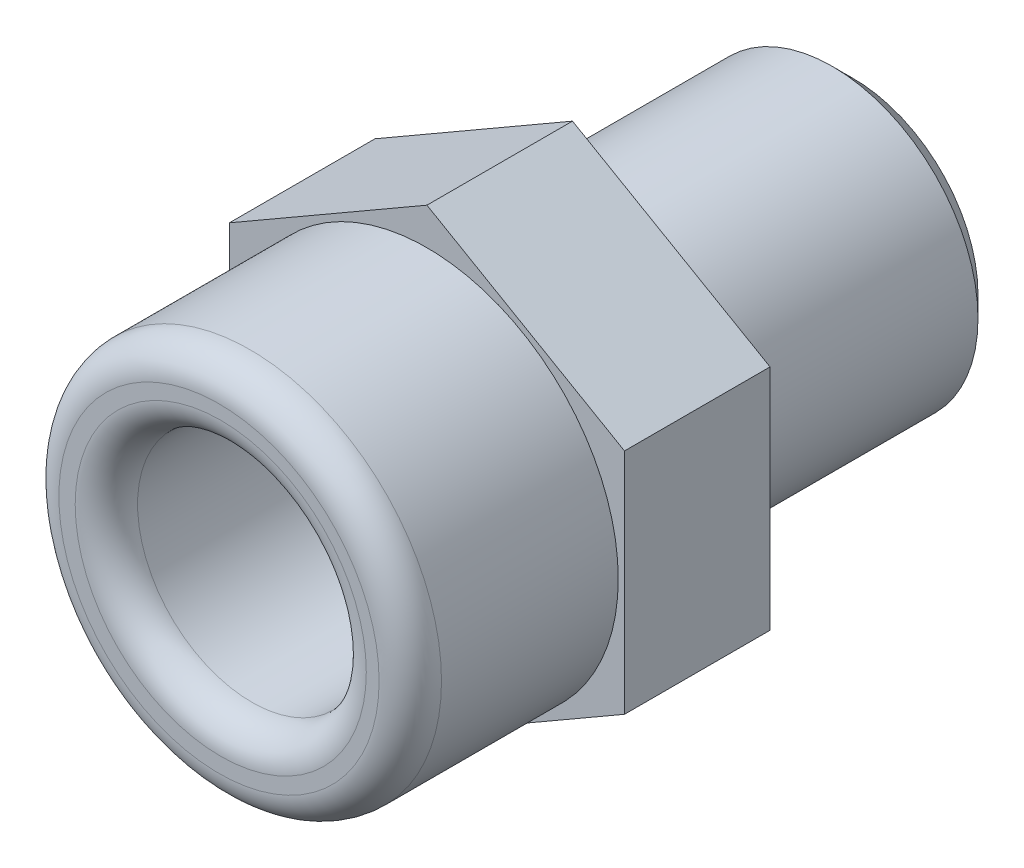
ISO-10303-21;
HEADER;
FILE_DESCRIPTION(('STEP AP214'),'2;1');
FILE_NAME('part.step','',(''),(''),'','','');
FILE_SCHEMA(('AUTOMOTIVE_DESIGN { 1 0 10303 214 1 1 1 1 }'));
ENDSEC;
DATA;
#1=APPLICATION_CONTEXT('core data for automotive mechanical design processes');
#2=APPLICATION_PROTOCOL_DEFINITION('international standard','automotive_design',2000,#1);
#3=PRODUCT_CONTEXT('',#1,'mechanical');
#4=PRODUCT('Part','Part','',(#3));
#5=PRODUCT_RELATED_PRODUCT_CATEGORY('part','',(#4));
#6=PRODUCT_DEFINITION_FORMATION('','',#4);
#7=PRODUCT_DEFINITION_CONTEXT('part definition',#1,'design');
#8=PRODUCT_DEFINITION('design','',#6,#7);
#9=PRODUCT_DEFINITION_SHAPE('','',#8);
#10=(LENGTH_UNIT() NAMED_UNIT(*) SI_UNIT(.MILLI.,.METRE.));
#11=(NAMED_UNIT(*) PLANE_ANGLE_UNIT() SI_UNIT($,.RADIAN.));
#12=(NAMED_UNIT(*) SI_UNIT($,.STERADIAN.) SOLID_ANGLE_UNIT());
#13=UNCERTAINTY_MEASURE_WITH_UNIT(LENGTH_MEASURE(1.E-05),#10,'distance_accuracy_value','');
#14=(GEOMETRIC_REPRESENTATION_CONTEXT(3) GLOBAL_UNCERTAINTY_ASSIGNED_CONTEXT((#13)) GLOBAL_UNIT_ASSIGNED_CONTEXT((#10,
#11,#12)) REPRESENTATION_CONTEXT('',''));
#15=CARTESIAN_POINT('',(0.,0.,0.));
#16=DIRECTION('',(0.,0.,1.));
#17=DIRECTION('',(1.,0.,0.));
#18=AXIS2_PLACEMENT_3D('',#15,#16,#17);
#19=CARTESIAN_POINT('',(-9.50000000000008,-5.48482755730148,0.));
#20=DIRECTION('',(0.,0.,-0.999999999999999));
#21=DIRECTION('',(-1.,0.,0.));
#22=AXIS2_PLACEMENT_3D('',#19,#20,#21);
#23=PLANE('',#22);
#24=DIRECTION('',(0.866025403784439,-0.5,0.));
#25=VECTOR('',#24,1.);
#26=CARTESIAN_POINT('',(-9.50000000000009,-5.48482755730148,0.));
#27=LINE('',#26,#25);
#28=CARTESIAN_POINT('',(-9.50000000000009,-5.48482755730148,0.));
#29=VERTEX_POINT('',#28);
#30=CARTESIAN_POINT('',(0.,-10.9696551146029,0.));
#31=VERTEX_POINT('',#30);
#32=EDGE_CURVE('E416',#29,#31,#27,.T.);
#33=ORIENTED_EDGE('',*,*,#32,.F.);
#34=DIRECTION('',(0.,-1.,0.));
#35=VECTOR('',#34,1.);
#36=CARTESIAN_POINT('',(-9.50000000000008,5.48482755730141,0.));
#37=LINE('',#36,#35);
#38=CARTESIAN_POINT('',(-9.50000000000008,5.48482755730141,0.));
#39=VERTEX_POINT('',#38);
#40=EDGE_CURVE('E446',#39,#29,#37,.T.);
#41=ORIENTED_EDGE('',*,*,#40,.F.);
#42=DIRECTION('',(-0.866025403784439,-0.5,0.));
#43=VECTOR('',#42,1.);
#44=CARTESIAN_POINT('',(0.,10.9696551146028,0.));
#45=LINE('',#44,#43);
#46=CARTESIAN_POINT('',(0.,10.9696551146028,0.));
#47=VERTEX_POINT('',#46);
#48=EDGE_CURVE('E444',#47,#39,#45,.T.);
#49=ORIENTED_EDGE('',*,*,#48,.F.);
#50=DIRECTION('',(-0.866025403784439,0.5,0.));
#51=VECTOR('',#50,1.);
#52=CARTESIAN_POINT('',(9.49999999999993,5.48482755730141,0.));
#53=LINE('',#52,#51);
#54=CARTESIAN_POINT('',(9.49999999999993,5.48482755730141,0.));
#55=VERTEX_POINT('',#54);
#56=EDGE_CURVE('E442',#55,#47,#53,.T.);
#57=ORIENTED_EDGE('',*,*,#56,.F.);
#58=DIRECTION('',(0.,1.,0.));
#59=VECTOR('',#58,1.);
#60=CARTESIAN_POINT('',(9.49999999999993,-5.48482755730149,0.));
#61=LINE('',#60,#59);
#62=CARTESIAN_POINT('',(9.49999999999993,-5.48482755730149,0.));
#63=VERTEX_POINT('',#62);
#64=EDGE_CURVE('E418',#63,#55,#61,.T.);
#65=ORIENTED_EDGE('',*,*,#64,.F.);
#66=DIRECTION('',(0.866025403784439,0.500000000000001,0.));
#67=VECTOR('',#66,1.);
#68=CARTESIAN_POINT('',(0.,-10.9696551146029,0.));
#69=LINE('',#68,#67);
#70=EDGE_CURVE('E411',#31,#63,#69,.T.);
#71=ORIENTED_EDGE('',*,*,#70,.F.);
#72=EDGE_LOOP('',(#33,#41,#49,#57,#65,#71));
#73=FACE_BOUND('',#72,.T.);
#74=CARTESIAN_POINT('',(0.,0.,0.));
#75=DIRECTION('',(0.,0.,-0.999999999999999));
#76=DIRECTION('',(-1.,0.,0.));
#77=AXIS2_PLACEMENT_3D('',#74,#75,#76);
#78=CIRCLE('',#77,7.);
#79=CARTESIAN_POINT('',(7.00000000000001,0.,0.));
#80=VERTEX_POINT('',#79);
#81=EDGE_CURVE('E434',#80,#80,#78,.T.);
#82=ORIENTED_EDGE('',*,*,#81,.F.);
#83=EDGE_LOOP('',(#82));
#84=FACE_BOUND('',#83,.T.);
#85=ADVANCED_FACE('F358',(#73,#84),#23,.T.);
#86=CARTESIAN_POINT('',(-9.50000000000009,-5.48482755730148,7.00000000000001));
#87=DIRECTION('',(0.,0.,-0.999999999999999));
#88=DIRECTION('',(-1.,0.,0.));
#89=AXIS2_PLACEMENT_3D('',#86,#87,#88);
#90=PLANE('',#89);
#91=DIRECTION('',(0.866025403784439,-0.5,0.));
#92=VECTOR('',#91,1.);
#93=CARTESIAN_POINT('',(-9.50000000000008,-5.48482755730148,7.00000000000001));
#94=LINE('',#93,#92);
#95=CARTESIAN_POINT('',(-9.50000000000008,-5.48482755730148,7.00000000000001));
#96=VERTEX_POINT('',#95);
#97=CARTESIAN_POINT('',(0.,-10.9696551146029,7.00000000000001));
#98=VERTEX_POINT('',#97);
#99=EDGE_CURVE('E448',#96,#98,#94,.T.);
#100=ORIENTED_EDGE('',*,*,#99,.T.);
#101=DIRECTION('',(0.866025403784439,0.500000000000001,0.));
#102=VECTOR('',#101,1.);
#103=CARTESIAN_POINT('',(0.,-10.9696551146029,7.00000000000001));
#104=LINE('',#103,#102);
#105=CARTESIAN_POINT('',(9.49999999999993,-5.48482755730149,7.00000000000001));
#106=VERTEX_POINT('',#105);
#107=EDGE_CURVE('E426',#98,#106,#104,.T.);
#108=ORIENTED_EDGE('',*,*,#107,.T.);
#109=DIRECTION('',(0.,1.,0.));
#110=VECTOR('',#109,1.);
#111=CARTESIAN_POINT('',(9.49999999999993,-5.48482755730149,7.00000000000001));
#112=LINE('',#111,#110);
#113=CARTESIAN_POINT('',(9.49999999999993,5.48482755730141,7.00000000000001));
#114=VERTEX_POINT('',#113);
#115=EDGE_CURVE('E451',#106,#114,#112,.T.);
#116=ORIENTED_EDGE('',*,*,#115,.T.);
#117=DIRECTION('',(-0.866025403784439,0.5,0.));
#118=VECTOR('',#117,1.);
#119=CARTESIAN_POINT('',(9.49999999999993,5.48482755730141,7.00000000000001));
#120=LINE('',#119,#118);
#121=CARTESIAN_POINT('',(0.,10.9696551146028,7.00000000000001));
#122=VERTEX_POINT('',#121);
#123=EDGE_CURVE('E453',#114,#122,#120,.T.);
#124=ORIENTED_EDGE('',*,*,#123,.T.);
#125=DIRECTION('',(-0.866025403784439,-0.5,0.));
#126=VECTOR('',#125,1.);
#127=CARTESIAN_POINT('',(0.,10.9696551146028,7.00000000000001));
#128=LINE('',#127,#126);
#129=CARTESIAN_POINT('',(-9.50000000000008,5.4848275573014,7.00000000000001));
#130=VERTEX_POINT('',#129);
#131=EDGE_CURVE('E378',#122,#130,#128,.T.);
#132=ORIENTED_EDGE('',*,*,#131,.T.);
#133=DIRECTION('',(0.,-1.,0.));
#134=VECTOR('',#133,1.);
#135=CARTESIAN_POINT('',(-9.50000000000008,5.4848275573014,7.00000000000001));
#136=LINE('',#135,#134);
#137=EDGE_CURVE('E373',#130,#96,#136,.T.);
#138=ORIENTED_EDGE('',*,*,#137,.T.);
#139=EDGE_LOOP('',(#100,#108,#116,#124,#132,#138));
#140=FACE_BOUND('',#139,.T.);
#141=CARTESIAN_POINT('',(0.,0.,7.00000000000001));
#142=DIRECTION('',(0.,0.,-0.999999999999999));
#143=DIRECTION('',(-1.,0.,0.));
#144=AXIS2_PLACEMENT_3D('',#141,#142,#143);
#145=CIRCLE('',#144,9.2);
#146=CARTESIAN_POINT('',(-9.20000000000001,0.,7.00000000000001));
#147=VERTEX_POINT('',#146);
#148=EDGE_CURVE('E429',#147,#147,#145,.F.);
#149=ORIENTED_EDGE('',*,*,#148,.F.);
#150=EDGE_LOOP('',(#149));
#151=FACE_BOUND('',#150,.T.);
#152=ADVANCED_FACE('F556',(#140,#151),#90,.F.);
#153=CARTESIAN_POINT('',(-9.50000000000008,-5.48482755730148,7.00000000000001));
#154=DIRECTION('',(0.5,0.866025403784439,0.));
#155=DIRECTION('',(-0.866025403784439,0.5,0.));
#156=AXIS2_PLACEMENT_3D('',#153,#154,#155);
#157=PLANE('',#156);
#158=ORIENTED_EDGE('',*,*,#32,.T.);
#159=DIRECTION('',(0.,0.,-0.999999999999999));
#160=VECTOR('',#159,1.);
#161=CARTESIAN_POINT('',(0.,-10.9696551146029,7.00000000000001));
#162=LINE('',#161,#160);
#163=EDGE_CURVE('E424',#98,#31,#162,.T.);
#164=ORIENTED_EDGE('',*,*,#163,.F.);
#165=ORIENTED_EDGE('',*,*,#99,.F.);
#166=DIRECTION('',(0.,0.,-0.999999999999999));
#167=VECTOR('',#166,1.);
#168=CARTESIAN_POINT('',(-9.50000000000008,-5.48482755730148,7.00000000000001));
#169=LINE('',#168,#167);
#170=EDGE_CURVE('E433',#96,#29,#169,.T.);
#171=ORIENTED_EDGE('',*,*,#170,.T.);
#172=EDGE_LOOP('',(#158,#164,#165,#171));
#173=FACE_BOUND('',#172,.T.);
#174=ADVANCED_FACE('F360',(#173),#157,.F.);
#175=CARTESIAN_POINT('',(0.,-10.9696551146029,7.00000000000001));
#176=DIRECTION('',(-0.500000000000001,0.866025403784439,0.));
#177=DIRECTION('',(-0.866025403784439,-0.500000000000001,0.));
#178=AXIS2_PLACEMENT_3D('',#175,#176,#177);
#179=PLANE('',#178);
#180=ORIENTED_EDGE('',*,*,#70,.T.);
#181=DIRECTION('',(0.,0.,-0.999999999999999));
#182=VECTOR('',#181,1.);
#183=CARTESIAN_POINT('',(9.49999999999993,-5.48482755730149,7.00000000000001));
#184=LINE('',#183,#182);
#185=EDGE_CURVE('E430',#106,#63,#184,.T.);
#186=ORIENTED_EDGE('',*,*,#185,.F.);
#187=ORIENTED_EDGE('',*,*,#107,.F.);
#188=ORIENTED_EDGE('',*,*,#163,.T.);
#189=EDGE_LOOP('',(#180,#186,#187,#188));
#190=FACE_BOUND('',#189,.T.);
#191=ADVANCED_FACE('F425',(#190),#179,.F.);
#192=CARTESIAN_POINT('',(9.49999999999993,-5.48482755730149,7.00000000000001));
#193=DIRECTION('',(-1.,0.,0.));
#194=DIRECTION('',(0.,-1.,0.));
#195=AXIS2_PLACEMENT_3D('',#192,#193,#194);
#196=PLANE('',#195);
#197=ORIENTED_EDGE('',*,*,#64,.T.);
#198=DIRECTION('',(0.,0.,-0.999999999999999));
#199=VECTOR('',#198,1.);
#200=CARTESIAN_POINT('',(9.49999999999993,5.48482755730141,7.00000000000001));
#201=LINE('',#200,#199);
#202=EDGE_CURVE('E464',#114,#55,#201,.T.);
#203=ORIENTED_EDGE('',*,*,#202,.F.);
#204=ORIENTED_EDGE('',*,*,#115,.F.);
#205=ORIENTED_EDGE('',*,*,#185,.T.);
#206=EDGE_LOOP('',(#197,#203,#204,#205));
#207=FACE_BOUND('',#206,.T.);
#208=ADVANCED_FACE('F575',(#207),#196,.F.);
#209=CARTESIAN_POINT('',(9.49999999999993,5.48482755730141,7.00000000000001));
#210=DIRECTION('',(-0.5,-0.866025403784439,0.));
#211=DIRECTION('',(0.866025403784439,-0.5,0.));
#212=AXIS2_PLACEMENT_3D('',#209,#210,#211);
#213=PLANE('',#212);
#214=ORIENTED_EDGE('',*,*,#56,.T.);
#215=DIRECTION('',(0.,0.,-0.999999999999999));
#216=VECTOR('',#215,1.);
#217=CARTESIAN_POINT('',(0.,10.9696551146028,7.00000000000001));
#218=LINE('',#217,#216);
#219=EDGE_CURVE('E461',#122,#47,#218,.T.);
#220=ORIENTED_EDGE('',*,*,#219,.F.);
#221=ORIENTED_EDGE('',*,*,#123,.F.);
#222=ORIENTED_EDGE('',*,*,#202,.T.);
#223=EDGE_LOOP('',(#214,#220,#221,#222));
#224=FACE_BOUND('',#223,.T.);
#225=ADVANCED_FACE('F571',(#224),#213,.F.);
#226=CARTESIAN_POINT('',(0.,10.9696551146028,7.00000000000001));
#227=DIRECTION('',(0.5,-0.866025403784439,0.));
#228=DIRECTION('',(0.866025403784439,0.5,0.));
#229=AXIS2_PLACEMENT_3D('',#226,#227,#228);
#230=PLANE('',#229);
#231=ORIENTED_EDGE('',*,*,#48,.T.);
#232=DIRECTION('',(0.,0.,-0.999999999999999));
#233=VECTOR('',#232,1.);
#234=CARTESIAN_POINT('',(-9.50000000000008,5.4848275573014,7.00000000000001));
#235=LINE('',#234,#233);
#236=EDGE_CURVE('E458',#130,#39,#235,.T.);
#237=ORIENTED_EDGE('',*,*,#236,.F.);
#238=ORIENTED_EDGE('',*,*,#131,.F.);
#239=ORIENTED_EDGE('',*,*,#219,.T.);
#240=EDGE_LOOP('',(#231,#237,#238,#239));
#241=FACE_BOUND('',#240,.T.);
#242=ADVANCED_FACE('F567',(#241),#230,.F.);
#243=CARTESIAN_POINT('',(-9.50000000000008,5.4848275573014,7.00000000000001));
#244=DIRECTION('',(1.,0.,0.));
#245=DIRECTION('',(0.,1.,0.));
#246=AXIS2_PLACEMENT_3D('',#243,#244,#245);
#247=PLANE('',#246);
#248=ORIENTED_EDGE('',*,*,#40,.T.);
#249=ORIENTED_EDGE('',*,*,#170,.F.);
#250=ORIENTED_EDGE('',*,*,#137,.F.);
#251=ORIENTED_EDGE('',*,*,#236,.T.);
#252=EDGE_LOOP('',(#248,#249,#250,#251));
#253=FACE_BOUND('',#252,.T.);
#254=ADVANCED_FACE('F564',(#253),#247,.F.);
#255=CARTESIAN_POINT('',(0.,0.,17.));
#256=DIRECTION('',(0.,0.,-0.999999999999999));
#257=DIRECTION('',(-1.,0.,0.));
#258=AXIS2_PLACEMENT_3D('',#255,#256,#257);
#259=CYLINDRICAL_SURFACE('',#258,9.2);
#260=CARTESIAN_POINT('',(0.,0.,15.5));
#261=DIRECTION('',(0.,0.,0.999999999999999));
#262=DIRECTION('',(1.,0.,0.));
#263=AXIS2_PLACEMENT_3D('',#260,#261,#262);
#264=CIRCLE('',#263,9.2);
#265=CARTESIAN_POINT('',(-9.2,0.,15.5));
#266=VERTEX_POINT('',#265);
#267=EDGE_CURVE('E366',#266,#266,#264,.F.);
#268=CARTESIAN_POINT('',(-9.2,0.,15.5));
#269=CARTESIAN_POINT('',(-9.2,0.,15.4114583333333));
#270=CARTESIAN_POINT('',(-9.2,0.,15.3229166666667));
#271=CARTESIAN_POINT('',(-9.2,0.,15.1458333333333));
#272=CARTESIAN_POINT('',(-9.2,0.,15.0572916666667));
#273=CARTESIAN_POINT('',(-9.2,0.,14.8802083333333));
#274=CARTESIAN_POINT('',(-9.2,0.,14.7916666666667));
#275=CARTESIAN_POINT('',(-9.2,0.,14.6145833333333));
#276=CARTESIAN_POINT('',(-9.20000000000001,0.,14.5260416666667));
#277=CARTESIAN_POINT('',(-9.20000000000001,0.,14.3489583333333));
#278=CARTESIAN_POINT('',(-9.20000000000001,0.,14.2604166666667));
#279=CARTESIAN_POINT('',(-9.20000000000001,0.,14.0833333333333));
#280=CARTESIAN_POINT('',(-9.20000000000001,0.,13.9947916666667));
#281=CARTESIAN_POINT('',(-9.20000000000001,0.,13.8177083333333));
#282=CARTESIAN_POINT('',(-9.20000000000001,0.,13.7291666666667));
#283=CARTESIAN_POINT('',(-9.20000000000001,0.,13.5520833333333));
#284=CARTESIAN_POINT('',(-9.20000000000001,0.,13.4635416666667));
#285=CARTESIAN_POINT('',(-9.20000000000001,0.,13.2864583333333));
#286=CARTESIAN_POINT('',(-9.20000000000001,0.,13.1979166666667));
#287=CARTESIAN_POINT('',(-9.20000000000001,0.,13.0208333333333));
#288=CARTESIAN_POINT('',(-9.20000000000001,0.,12.9322916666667));
#289=CARTESIAN_POINT('',(-9.20000000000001,0.,12.7552083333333));
#290=CARTESIAN_POINT('',(-9.20000000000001,0.,12.6666666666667));
#291=CARTESIAN_POINT('',(-9.20000000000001,0.,12.4895833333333));
#292=CARTESIAN_POINT('',(-9.20000000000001,0.,12.4010416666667));
#293=CARTESIAN_POINT('',(-9.20000000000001,0.,12.2239583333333));
#294=CARTESIAN_POINT('',(-9.20000000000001,0.,12.1354166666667));
#295=CARTESIAN_POINT('',(-9.20000000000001,0.,11.9583333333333));
#296=CARTESIAN_POINT('',(-9.20000000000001,0.,11.8697916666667));
#297=CARTESIAN_POINT('',(-9.20000000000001,0.,11.6927083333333));
#298=CARTESIAN_POINT('',(-9.20000000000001,0.,11.6041666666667));
#299=CARTESIAN_POINT('',(-9.20000000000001,0.,11.4270833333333));
#300=CARTESIAN_POINT('',(-9.20000000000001,0.,11.3385416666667));
#301=CARTESIAN_POINT('',(-9.20000000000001,0.,11.1614583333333));
#302=CARTESIAN_POINT('',(-9.20000000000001,0.,11.0729166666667));
#303=CARTESIAN_POINT('',(-9.20000000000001,0.,10.8958333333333));
#304=CARTESIAN_POINT('',(-9.20000000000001,0.,10.8072916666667));
#305=CARTESIAN_POINT('',(-9.20000000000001,0.,10.6302083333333));
#306=CARTESIAN_POINT('',(-9.20000000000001,0.,10.5416666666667));
#307=CARTESIAN_POINT('',(-9.20000000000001,0.,10.3645833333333));
#308=CARTESIAN_POINT('',(-9.20000000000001,0.,10.2760416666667));
#309=CARTESIAN_POINT('',(-9.20000000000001,0.,10.0989583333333));
#310=CARTESIAN_POINT('',(-9.20000000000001,0.,10.0104166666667));
#311=CARTESIAN_POINT('',(-9.20000000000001,0.,9.83333333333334));
#312=CARTESIAN_POINT('',(-9.20000000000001,0.,9.74479166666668));
#313=CARTESIAN_POINT('',(-9.20000000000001,0.,9.56770833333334));
#314=CARTESIAN_POINT('',(-9.20000000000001,0.,9.47916666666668));
#315=CARTESIAN_POINT('',(-9.20000000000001,0.,9.30208333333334));
#316=CARTESIAN_POINT('',(-9.20000000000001,0.,9.21354166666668));
#317=CARTESIAN_POINT('',(-9.20000000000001,0.,9.03645833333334));
#318=CARTESIAN_POINT('',(-9.20000000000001,0.,8.94791666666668));
#319=CARTESIAN_POINT('',(-9.20000000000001,0.,8.77083333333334));
#320=CARTESIAN_POINT('',(-9.20000000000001,0.,8.68229166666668));
#321=CARTESIAN_POINT('',(-9.20000000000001,0.,8.50520833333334));
#322=CARTESIAN_POINT('',(-9.20000000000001,0.,8.41666666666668));
#323=CARTESIAN_POINT('',(-9.20000000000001,0.,8.23958333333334));
#324=CARTESIAN_POINT('',(-9.20000000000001,0.,8.15104166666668));
#325=CARTESIAN_POINT('',(-9.20000000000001,0.,7.97395833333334));
#326=CARTESIAN_POINT('',(-9.20000000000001,0.,7.88541666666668));
#327=CARTESIAN_POINT('',(-9.20000000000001,0.,7.70833333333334));
#328=CARTESIAN_POINT('',(-9.20000000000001,0.,7.61979166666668));
#329=CARTESIAN_POINT('',(-9.20000000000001,0.,7.44270833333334));
#330=CARTESIAN_POINT('',(-9.20000000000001,0.,7.35416666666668));
#331=CARTESIAN_POINT('',(-9.20000000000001,0.,7.17708333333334));
#332=CARTESIAN_POINT('',(-9.20000000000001,0.,7.08854166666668));
#333=CARTESIAN_POINT('',(-9.20000000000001,0.,7.00000000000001));
#334=B_SPLINE_CURVE_WITH_KNOTS('',3,(#268,#269,#270,#271,#272,#273,#274,#275,#276,#277,#278,
#279,#280,#281,#282,#283,#284,#285,#286,#287,#288,#289,#290,#291,#292,#293,#294,#295,#296,#297,
#298,#299,#300,#301,#302,#303,#304,#305,#306,#307,#308,#309,#310,#311,#312,#313,#314,#315,#316,
#317,#318,#319,#320,#321,#322,#323,#324,#325,#326,#327,#328,#329,#330,#331,#332,#333),
.UNSPECIFIED.,.F.,.F.,(4,2,2,2,2,2,2,2,2,2,2,2,2,2,2,2,2,2,2,2,2,2,2,2,2,2,2,2,2,2,2,2,4),(0.,
0.265625,0.53125,0.796875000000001,1.0625,1.328125,1.59375,1.859375,2.125,2.390625,2.65625,
2.921875,3.1875,3.453125,3.71875,3.984375,4.25,4.515625,4.78125,5.046875,5.3125,
5.57812500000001,5.84375,6.109375,6.375,6.64062500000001,6.90625000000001,7.17187500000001,
7.43750000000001,7.70312500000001,7.96875000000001,8.23437500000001,8.50000000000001),.UNSPECIFIED.);
#335=EDGE_CURVE('BSEAM484',#266,#147,#334,.T.);
#336=ORIENTED_EDGE('',*,*,#267,.T.);
#337=ORIENTED_EDGE('',*,*,#148,.T.);
#338=ORIENTED_EDGE('',*,*,#335,.T.);
#339=ORIENTED_EDGE('',*,*,#335,.F.);
#340=EDGE_LOOP('',(#336,#338,#337,#339));
#341=FACE_BOUND('',#340,.T.);
#342=ADVANCED_FACE('F484',(#341),#259,.T.);
#343=CARTESIAN_POINT('',(0.,0.,17.));
#344=DIRECTION('',(0.,0.,0.999999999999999));
#345=DIRECTION('',(1.,0.,0.));
#346=AXIS2_PLACEMENT_3D('',#343,#344,#345);
#347=PLANE('',#346);
#348=CARTESIAN_POINT('',(0.,0.,17.));
#349=DIRECTION('',(0.,0.,0.999999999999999));
#350=DIRECTION('',(1.,0.,0.));
#351=AXIS2_PLACEMENT_3D('',#348,#349,#350);
#352=CIRCLE('',#351,7.7);
#353=CARTESIAN_POINT('',(7.7,0.,17.));
#354=VERTEX_POINT('',#353);
#355=EDGE_CURVE('E479',#354,#354,#352,.T.);
#356=ORIENTED_EDGE('',*,*,#355,.T.);
#357=EDGE_LOOP('',(#356));
#358=FACE_BOUND('',#357,.T.);
#359=CARTESIAN_POINT('',(0.0838658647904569,0.0559105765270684,17.));
#360=DIRECTION('',(0.,0.,0.999999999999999));
#361=DIRECTION('',(1.,0.,0.));
#362=AXIS2_PLACEMENT_3D('',#359,#360,#361);
#363=CIRCLE('',#362,7.);
#364=CARTESIAN_POINT('',(7.08386586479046,0.0559105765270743,17.));
#365=VERTEX_POINT('',#364);
#366=EDGE_CURVE('E476',#365,#365,#363,.F.);
#367=ORIENTED_EDGE('',*,*,#366,.T.);
#368=EDGE_LOOP('',(#367));
#369=FACE_BOUND('',#368,.T.);
#370=ADVANCED_FACE('F495',(#358,#369),#347,.T.);
#371=CARTESIAN_POINT('',(0.,0.,-13.5));
#372=DIRECTION('',(0.,0.,0.999999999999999));
#373=DIRECTION('',(1.,0.,0.));
#374=AXIS2_PLACEMENT_3D('',#371,#372,#373);
#375=CYLINDRICAL_SURFACE('',#374,7.);
#376=CARTESIAN_POINT('',(0.,0.,-12.5));
#377=DIRECTION('',(0.,0.,-0.999999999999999));
#378=DIRECTION('',(-1.,0.,0.));
#379=AXIS2_PLACEMENT_3D('',#376,#377,#378);
#380=CIRCLE('',#379,7.);
#381=CARTESIAN_POINT('',(7.,0.,-12.5));
#382=VERTEX_POINT('',#381);
#383=EDGE_CURVE('E473',#382,#382,#380,.F.);
#384=CARTESIAN_POINT('',(7.,0.,-12.5));
#385=CARTESIAN_POINT('',(7.,0.,-12.3697916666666));
#386=CARTESIAN_POINT('',(7.,0.,-12.2395833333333));
#387=CARTESIAN_POINT('',(7.,0.,-11.9791666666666));
#388=CARTESIAN_POINT('',(7.,0.,-11.8489583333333));
#389=CARTESIAN_POINT('',(7.,0.,-11.5885416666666));
#390=CARTESIAN_POINT('',(7.,0.,-11.4583333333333));
#391=CARTESIAN_POINT('',(7.,0.,-11.1979166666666));
#392=CARTESIAN_POINT('',(7.,0.,-11.0677083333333));
#393=CARTESIAN_POINT('',(7.,0.,-10.8072916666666));
#394=CARTESIAN_POINT('',(7.,0.,-10.6770833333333));
#395=CARTESIAN_POINT('',(7.,0.,-10.4166666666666));
#396=CARTESIAN_POINT('',(7.,0.,-10.2864583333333));
#397=CARTESIAN_POINT('',(7.,0.,-10.0260416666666));
#398=CARTESIAN_POINT('',(7.,0.,-9.89583333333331));
#399=CARTESIAN_POINT('',(7.,0.,-9.63541666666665));
#400=CARTESIAN_POINT('',(7.,0.,-9.50520833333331));
#401=CARTESIAN_POINT('',(7.,0.,-9.24479166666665));
#402=CARTESIAN_POINT('',(7.,0.,-9.11458333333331));
#403=CARTESIAN_POINT('',(7.,0.,-8.85416666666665));
#404=CARTESIAN_POINT('',(7.,0.,-8.72395833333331));
#405=CARTESIAN_POINT('',(7.,0.,-8.46354166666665));
#406=CARTESIAN_POINT('',(7.,0.,-8.33333333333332));
#407=CARTESIAN_POINT('',(7.,0.,-8.07291666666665));
#408=CARTESIAN_POINT('',(7.,0.,-7.94270833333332));
#409=CARTESIAN_POINT('',(7.,0.,-7.68229166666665));
#410=CARTESIAN_POINT('',(7.,0.,-7.55208333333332));
#411=CARTESIAN_POINT('',(7.,0.,-7.29166666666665));
#412=CARTESIAN_POINT('',(7.,0.,-7.16145833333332));
#413=CARTESIAN_POINT('',(7.,0.,-6.90104166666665));
#414=CARTESIAN_POINT('',(7.,0.,-6.77083333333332));
#415=CARTESIAN_POINT('',(7.,0.,-6.51041666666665));
#416=CARTESIAN_POINT('',(7.,0.,-6.38020833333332));
#417=CARTESIAN_POINT('',(7.,0.,-6.11979166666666));
#418=CARTESIAN_POINT('',(7.,0.,-5.98958333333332));
#419=CARTESIAN_POINT('',(7.,0.,-5.72916666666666));
#420=CARTESIAN_POINT('',(7.,0.,-5.59895833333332));
#421=CARTESIAN_POINT('',(7.,0.,-5.33854166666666));
#422=CARTESIAN_POINT('',(7.00000000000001,0.,-5.20833333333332));
#423=CARTESIAN_POINT('',(7.00000000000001,0.,-4.94791666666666));
#424=CARTESIAN_POINT('',(7.00000000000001,0.,-4.81770833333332));
#425=CARTESIAN_POINT('',(7.00000000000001,0.,-4.55729166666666));
#426=CARTESIAN_POINT('',(7.00000000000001,0.,-4.42708333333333));
#427=CARTESIAN_POINT('',(7.00000000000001,0.,-4.16666666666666));
#428=CARTESIAN_POINT('',(7.00000000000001,0.,-4.03645833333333));
#429=CARTESIAN_POINT('',(7.00000000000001,0.,-3.77604166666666));
#430=CARTESIAN_POINT('',(7.00000000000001,0.,-3.64583333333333));
#431=CARTESIAN_POINT('',(7.00000000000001,0.,-3.38541666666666));
#432=CARTESIAN_POINT('',(7.00000000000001,0.,-3.25520833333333));
#433=CARTESIAN_POINT('',(7.00000000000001,0.,-2.99479166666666));
#434=CARTESIAN_POINT('',(7.00000000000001,0.,-2.86458333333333));
#435=CARTESIAN_POINT('',(7.00000000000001,0.,-2.60416666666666));
#436=CARTESIAN_POINT('',(7.00000000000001,0.,-2.47395833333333));
#437=CARTESIAN_POINT('',(7.00000000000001,0.,-2.21354166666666));
#438=CARTESIAN_POINT('',(7.00000000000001,0.,-2.08333333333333));
#439=CARTESIAN_POINT('',(7.00000000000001,0.,-1.82291666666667));
#440=CARTESIAN_POINT('',(7.00000000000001,0.,-1.69270833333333));
#441=CARTESIAN_POINT('',(7.00000000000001,0.,-1.43229166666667));
#442=CARTESIAN_POINT('',(7.00000000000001,0.,-1.30208333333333));
#443=CARTESIAN_POINT('',(7.00000000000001,0.,-1.04166666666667));
#444=CARTESIAN_POINT('',(7.00000000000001,0.,-0.911458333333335));
#445=CARTESIAN_POINT('',(7.00000000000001,0.,-0.651041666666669));
#446=CARTESIAN_POINT('',(7.00000000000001,0.,-0.520833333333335));
#447=CARTESIAN_POINT('',(7.00000000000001,0.,-0.260416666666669));
#448=CARTESIAN_POINT('',(7.00000000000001,0.,-0.130208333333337));
#449=CARTESIAN_POINT('',(7.00000000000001,0.,0.));
#450=B_SPLINE_CURVE_WITH_KNOTS('',3,(#384,#385,#386,#387,#388,#389,#390,#391,#392,#393,#394,
#395,#396,#397,#398,#399,#400,#401,#402,#403,#404,#405,#406,#407,#408,#409,#410,#411,#412,#413,
#414,#415,#416,#417,#418,#419,#420,#421,#422,#423,#424,#425,#426,#427,#428,#429,#430,#431,#432,
#433,#434,#435,#436,#437,#438,#439,#440,#441,#442,#443,#444,#445,#446,#447,#448,#449),
.UNSPECIFIED.,.F.,.F.,(4,2,2,2,2,2,2,2,2,2,2,2,2,2,2,2,2,2,2,2,2,2,2,2,2,2,2,2,2,2,2,2,4),(0.,
0.390624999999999,0.781249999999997,1.171875,1.5625,1.95312499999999,2.34374999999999,
2.73437499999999,3.12499999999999,3.51562499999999,3.90624999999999,4.29687499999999,
4.68749999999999,5.07812499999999,5.46874999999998,5.85937499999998,6.24999999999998,
6.64062499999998,7.03124999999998,7.42187499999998,7.81249999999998,8.20312499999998,
8.59374999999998,8.98437499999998,9.37499999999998,9.76562499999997,10.15625,10.546875,10.9375,
11.328125,11.71875,12.109375,12.5),.UNSPECIFIED.);
#451=EDGE_CURVE('BSEAM498',#382,#80,#450,.T.);
#452=ORIENTED_EDGE('',*,*,#383,.T.);
#453=ORIENTED_EDGE('',*,*,#81,.T.);
#454=ORIENTED_EDGE('',*,*,#451,.T.);
#455=ORIENTED_EDGE('',*,*,#451,.F.);
#456=EDGE_LOOP('',(#452,#454,#453,#455));
#457=FACE_BOUND('',#456,.T.);
#458=ADVANCED_FACE('F498',(#457),#375,.T.);
#459=CARTESIAN_POINT('',(0.,0.,-13.5));
#460=DIRECTION('',(0.,0.,-0.999999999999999));
#461=DIRECTION('',(-1.,0.,0.));
#462=AXIS2_PLACEMENT_3D('',#459,#460,#461);
#463=PLANE('',#462);
#464=CARTESIAN_POINT('',(0.,0.,-13.5));
#465=DIRECTION('',(0.,0.,-0.999999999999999));
#466=DIRECTION('',(-1.,0.,0.));
#467=AXIS2_PLACEMENT_3D('',#464,#465,#466);
#468=CIRCLE('',#467,5.75);
#469=CARTESIAN_POINT('',(-5.75000000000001,0.,-13.5));
#470=VERTEX_POINT('',#469);
#471=EDGE_CURVE('E518',#470,#470,#468,.T.);
#472=ORIENTED_EDGE('',*,*,#471,.F.);
#473=EDGE_LOOP('',(#472));
#474=FACE_BOUND('',#473,.T.);
#475=CARTESIAN_POINT('',(0.,0.,-13.5));
#476=DIRECTION('',(0.,0.,-0.999999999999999));
#477=DIRECTION('',(-1.,0.,0.));
#478=AXIS2_PLACEMENT_3D('',#475,#476,#477);
#479=CIRCLE('',#478,5.99999999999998);
#480=CARTESIAN_POINT('',(5.99999999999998,0.,-13.5));
#481=VERTEX_POINT('',#480);
#482=EDGE_CURVE('E470',#481,#481,#479,.T.);
#483=ORIENTED_EDGE('',*,*,#482,.T.);
#484=EDGE_LOOP('',(#483));
#485=FACE_BOUND('',#484,.T.);
#486=ADVANCED_FACE('F543',(#474,#485),#463,.T.);
#487=CARTESIAN_POINT('',(0.,0.,-13.5));
#488=DIRECTION('',(0.,0.,0.999999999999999));
#489=DIRECTION('',(1.,0.,0.));
#490=AXIS2_PLACEMENT_3D('',#487,#488,#489);
#491=CONICAL_SURFACE('',#490,5.99999999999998,0.785398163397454);
#492=CARTESIAN_POINT('',(7.00000000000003,0.,-12.5));
#493=CARTESIAN_POINT('',(6.98958333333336,0.,-12.5104166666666));
#494=CARTESIAN_POINT('',(6.9791666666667,0.,-12.5208333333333));
#495=CARTESIAN_POINT('',(6.95833333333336,0.,-12.5416666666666));
#496=CARTESIAN_POINT('',(6.9479166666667,0.,-12.5520833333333));
#497=CARTESIAN_POINT('',(6.92708333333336,0.,-12.5729166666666));
#498=CARTESIAN_POINT('',(6.91666666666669,0.,-12.5833333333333));
#499=CARTESIAN_POINT('',(6.89583333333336,0.,-12.6041666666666));
#500=CARTESIAN_POINT('',(6.88541666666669,0.,-12.6145833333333));
#501=CARTESIAN_POINT('',(6.86458333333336,0.,-12.6354166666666));
#502=CARTESIAN_POINT('',(6.85416666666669,0.,-12.6458333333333));
#503=CARTESIAN_POINT('',(6.83333333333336,0.,-12.6666666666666));
#504=CARTESIAN_POINT('',(6.82291666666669,0.,-12.6770833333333));
#505=CARTESIAN_POINT('',(6.80208333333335,0.,-12.6979166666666));
#506=CARTESIAN_POINT('',(6.79166666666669,0.,-12.7083333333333));
#507=CARTESIAN_POINT('',(6.77083333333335,0.,-12.7291666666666));
#508=CARTESIAN_POINT('',(6.76041666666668,0.,-12.7395833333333));
#509=CARTESIAN_POINT('',(6.73958333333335,0.,-12.7604166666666));
#510=CARTESIAN_POINT('',(6.72916666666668,0.,-12.7708333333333));
#511=CARTESIAN_POINT('',(6.70833333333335,0.,-12.7916666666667));
#512=CARTESIAN_POINT('',(6.69791666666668,0.,-12.8020833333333));
#513=CARTESIAN_POINT('',(6.67708333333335,0.,-12.8229166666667));
#514=CARTESIAN_POINT('',(6.66666666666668,0.,-12.8333333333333));
#515=CARTESIAN_POINT('',(6.64583333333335,0.,-12.8541666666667));
#516=CARTESIAN_POINT('',(6.63541666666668,0.,-12.8645833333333));
#517=CARTESIAN_POINT('',(6.61458333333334,0.,-12.8854166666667));
#518=CARTESIAN_POINT('',(6.60416666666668,0.,-12.8958333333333));
#519=CARTESIAN_POINT('',(6.58333333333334,0.,-12.9166666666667));
#520=CARTESIAN_POINT('',(6.57291666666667,0.,-12.9270833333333));
#521=CARTESIAN_POINT('',(6.55208333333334,0.,-12.9479166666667));
#522=CARTESIAN_POINT('',(6.54166666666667,0.,-12.9583333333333));
#523=CARTESIAN_POINT('',(6.52083333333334,0.,-12.9791666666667));
#524=CARTESIAN_POINT('',(6.51041666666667,0.,-12.9895833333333));
#525=CARTESIAN_POINT('',(6.48958333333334,0.,-13.0104166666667));
#526=CARTESIAN_POINT('',(6.47916666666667,0.,-13.0208333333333));
#527=CARTESIAN_POINT('',(6.45833333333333,0.,-13.0416666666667));
#528=CARTESIAN_POINT('',(6.44791666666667,0.,-13.0520833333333));
#529=CARTESIAN_POINT('',(6.42708333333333,0.,-13.0729166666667));
#530=CARTESIAN_POINT('',(6.41666666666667,0.,-13.0833333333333));
#531=CARTESIAN_POINT('',(6.39583333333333,0.,-13.1041666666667));
#532=CARTESIAN_POINT('',(6.38541666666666,0.,-13.1145833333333));
#533=CARTESIAN_POINT('',(6.36458333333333,0.,-13.1354166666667));
#534=CARTESIAN_POINT('',(6.35416666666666,0.,-13.1458333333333));
#535=CARTESIAN_POINT('',(6.33333333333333,0.,-13.1666666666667));
#536=CARTESIAN_POINT('',(6.32291666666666,0.,-13.1770833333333));
#537=CARTESIAN_POINT('',(6.30208333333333,0.,-13.1979166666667));
#538=CARTESIAN_POINT('',(6.29166666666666,0.,-13.2083333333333));
#539=CARTESIAN_POINT('',(6.27083333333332,0.,-13.2291666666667));
#540=CARTESIAN_POINT('',(6.26041666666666,0.,-13.2395833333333));
#541=CARTESIAN_POINT('',(6.23958333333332,0.,-13.2604166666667));
#542=CARTESIAN_POINT('',(6.22916666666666,0.,-13.2708333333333));
#543=CARTESIAN_POINT('',(6.20833333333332,0.,-13.2916666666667));
#544=CARTESIAN_POINT('',(6.19791666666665,0.,-13.3020833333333));
#545=CARTESIAN_POINT('',(6.17708333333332,0.,-13.3229166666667));
#546=CARTESIAN_POINT('',(6.16666666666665,0.,-13.3333333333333));
#547=CARTESIAN_POINT('',(6.14583333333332,0.,-13.3541666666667));
#548=CARTESIAN_POINT('',(6.13541666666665,0.,-13.3645833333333));
#549=CARTESIAN_POINT('',(6.11458333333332,0.,-13.3854166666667));
#550=CARTESIAN_POINT('',(6.10416666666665,0.,-13.3958333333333));
#551=CARTESIAN_POINT('',(6.08333333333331,0.,-13.4166666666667));
#552=CARTESIAN_POINT('',(6.07291666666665,0.,-13.4270833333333));
#553=CARTESIAN_POINT('',(6.05208333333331,0.,-13.4479166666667));
#554=CARTESIAN_POINT('',(6.04166666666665,0.,-13.4583333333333));
#555=CARTESIAN_POINT('',(6.02083333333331,0.,-13.4791666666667));
#556=CARTESIAN_POINT('',(6.01041666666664,0.,-13.4895833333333));
#557=CARTESIAN_POINT('',(5.99999999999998,0.,-13.5));
#558=B_SPLINE_CURVE_WITH_KNOTS('',3,(#492,#493,#494,#495,#496,#497,#498,#499,#500,#501,#502,
#503,#504,#505,#506,#507,#508,#509,#510,#511,#512,#513,#514,#515,#516,#517,#518,#519,#520,#521,
#522,#523,#524,#525,#526,#527,#528,#529,#530,#531,#532,#533,#534,#535,#536,#537,#538,#539,#540,
#541,#542,#543,#544,#545,#546,#547,#548,#549,#550,#551,#552,#553,#554,#555,#556,#557),
.UNSPECIFIED.,.F.,.F.,(4,2,2,2,2,2,2,2,2,2,2,2,2,2,2,2,2,2,2,2,2,2,2,2,2,2,2,2,2,2,2,2,4),(0.,
0.0441941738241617,0.0883883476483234,0.132582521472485,0.176776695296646,0.220970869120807,
0.265165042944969,0.309359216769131,0.353553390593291,0.397747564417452,0.441941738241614,
0.486135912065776,0.530330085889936,0.574524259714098,0.61871843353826,0.662912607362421,
0.707106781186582,0.751300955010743,0.795495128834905,0.839689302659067,0.883883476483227,
0.928077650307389,0.972271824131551,1.01646599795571,1.06066017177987,1.10485434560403,
1.1490485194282,1.19324269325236,1.23743686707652,1.28163104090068,1.32582521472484,
1.370019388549,1.41421356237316),.UNSPECIFIED.);
#559=EDGE_CURVE('BSEAM511',#382,#481,#558,.T.);
#560=ORIENTED_EDGE('',*,*,#383,.F.);
#561=ORIENTED_EDGE('',*,*,#482,.F.);
#562=ORIENTED_EDGE('',*,*,#559,.T.);
#563=ORIENTED_EDGE('',*,*,#559,.F.);
#564=EDGE_LOOP('',(#560,#562,#561,#563));
#565=FACE_BOUND('',#564,.T.);
#566=ADVANCED_FACE('F511',(#565),#491,.T.);
#567=CARTESIAN_POINT('',(0.0838658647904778,0.0559105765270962,4.20000000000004));
#568=DIRECTION('',(0.,0.,0.999999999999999));
#569=DIRECTION('',(1.,0.,0.));
#570=AXIS2_PLACEMENT_3D('',#567,#568,#569);
#571=CYLINDRICAL_SURFACE('',#570,5.5);
#572=CARTESIAN_POINT('',(0.0838658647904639,0.0559105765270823,15.5));
#573=DIRECTION('',(0.,0.,0.999999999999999));
#574=DIRECTION('',(1.,0.,0.));
#575=AXIS2_PLACEMENT_3D('',#572,#573,#574);
#576=CIRCLE('',#575,5.5);
#577=CARTESIAN_POINT('',(5.58386586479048,0.0559105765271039,15.5));
#578=VERTEX_POINT('',#577);
#579=EDGE_CURVE('E13',#578,#578,#576,.T.);
#580=CARTESIAN_POINT('',(0.0838658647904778,0.0559105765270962,4.20000000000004));
#581=DIRECTION('',(0.,0.,0.999999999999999));
#582=DIRECTION('',(1.,0.,0.));
#583=AXIS2_PLACEMENT_3D('',#580,#581,#582);
#584=CIRCLE('',#583,5.5);
#585=CARTESIAN_POINT('',(5.58386586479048,0.0559105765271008,4.20000000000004));
#586=VERTEX_POINT('',#585);
#587=EDGE_CURVE('E437',#586,#586,#584,.T.);
#588=CARTESIAN_POINT('',(5.58386586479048,0.0559105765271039,15.5));
#589=CARTESIAN_POINT('',(5.58386586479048,0.0559105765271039,15.3822916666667));
#590=CARTESIAN_POINT('',(5.58386586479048,0.0559105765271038,15.2645833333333));
#591=CARTESIAN_POINT('',(5.58386586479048,0.0559105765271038,15.0291666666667));
#592=CARTESIAN_POINT('',(5.58386586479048,0.0559105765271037,14.9114583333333));
#593=CARTESIAN_POINT('',(5.58386586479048,0.0559105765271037,14.6760416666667));
#594=CARTESIAN_POINT('',(5.58386586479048,0.0559105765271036,14.5583333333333));
#595=CARTESIAN_POINT('',(5.58386586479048,0.0559105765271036,14.3229166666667));
#596=CARTESIAN_POINT('',(5.58386586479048,0.0559105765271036,14.2052083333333));
#597=CARTESIAN_POINT('',(5.58386586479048,0.0559105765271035,13.9697916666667));
#598=CARTESIAN_POINT('',(5.58386586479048,0.0559105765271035,13.8520833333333));
#599=CARTESIAN_POINT('',(5.58386586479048,0.0559105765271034,13.6166666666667));
#600=CARTESIAN_POINT('',(5.58386586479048,0.0559105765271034,13.4989583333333));
#601=CARTESIAN_POINT('',(5.58386586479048,0.0559105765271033,13.2635416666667));
#602=CARTESIAN_POINT('',(5.58386586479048,0.0559105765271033,13.1458333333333));
#603=CARTESIAN_POINT('',(5.58386586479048,0.0559105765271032,12.9104166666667));
#604=CARTESIAN_POINT('',(5.58386586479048,0.0559105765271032,12.7927083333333));
#605=CARTESIAN_POINT('',(5.58386586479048,0.0559105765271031,12.5572916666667));
#606=CARTESIAN_POINT('',(5.58386586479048,0.0559105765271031,12.4395833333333));
#607=CARTESIAN_POINT('',(5.58386586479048,0.055910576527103,12.2041666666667));
#608=CARTESIAN_POINT('',(5.58386586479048,0.055910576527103,12.0864583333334));
#609=CARTESIAN_POINT('',(5.58386586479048,0.0559105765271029,11.8510416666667));
#610=CARTESIAN_POINT('',(5.58386586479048,0.0559105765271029,11.7333333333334));
#611=CARTESIAN_POINT('',(5.58386586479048,0.0559105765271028,11.4979166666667));
#612=CARTESIAN_POINT('',(5.58386586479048,0.0559105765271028,11.3802083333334));
#613=CARTESIAN_POINT('',(5.58386586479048,0.0559105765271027,11.1447916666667));
#614=CARTESIAN_POINT('',(5.58386586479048,0.0559105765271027,11.0270833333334));
#615=CARTESIAN_POINT('',(5.58386586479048,0.0559105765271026,10.7916666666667));
#616=CARTESIAN_POINT('',(5.58386586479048,0.0559105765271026,10.6739583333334));
#617=CARTESIAN_POINT('',(5.58386586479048,0.0559105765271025,10.4385416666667));
#618=CARTESIAN_POINT('',(5.58386586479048,0.0559105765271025,10.3208333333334));
#619=CARTESIAN_POINT('',(5.58386586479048,0.0559105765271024,10.0854166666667));
#620=CARTESIAN_POINT('',(5.58386586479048,0.0559105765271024,9.96770833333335));
#621=CARTESIAN_POINT('',(5.58386586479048,0.0559105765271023,9.73229166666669));
#622=CARTESIAN_POINT('',(5.58386586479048,0.0559105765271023,9.61458333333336));
#623=CARTESIAN_POINT('',(5.58386586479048,0.0559105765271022,9.37916666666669));
#624=CARTESIAN_POINT('',(5.58386586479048,0.0559105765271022,9.26145833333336));
#625=CARTESIAN_POINT('',(5.58386586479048,0.0559105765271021,9.02604166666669));
#626=CARTESIAN_POINT('',(5.58386586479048,0.0559105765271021,8.90833333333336));
#627=CARTESIAN_POINT('',(5.58386586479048,0.055910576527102,8.67291666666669));
#628=CARTESIAN_POINT('',(5.58386586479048,0.055910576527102,8.55520833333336));
#629=CARTESIAN_POINT('',(5.58386586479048,0.0559105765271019,8.31979166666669));
#630=CARTESIAN_POINT('',(5.58386586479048,0.0559105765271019,8.20208333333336));
#631=CARTESIAN_POINT('',(5.58386586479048,0.0559105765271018,7.96666666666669));
#632=CARTESIAN_POINT('',(5.58386586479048,0.0559105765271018,7.84895833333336));
#633=CARTESIAN_POINT('',(5.58386586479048,0.0559105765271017,7.61354166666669));
#634=CARTESIAN_POINT('',(5.58386586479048,0.0559105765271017,7.49583333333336));
#635=CARTESIAN_POINT('',(5.58386586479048,0.0559105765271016,7.26041666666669));
#636=CARTESIAN_POINT('',(5.58386586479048,0.0559105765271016,7.14270833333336));
#637=CARTESIAN_POINT('',(5.58386586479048,0.0559105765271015,6.9072916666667));
#638=CARTESIAN_POINT('',(5.58386586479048,0.0559105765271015,6.78958333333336));
#639=CARTESIAN_POINT('',(5.58386586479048,0.0559105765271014,6.5541666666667));
#640=CARTESIAN_POINT('',(5.58386586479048,0.0559105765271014,6.43645833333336));
#641=CARTESIAN_POINT('',(5.58386586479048,0.0559105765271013,6.2010416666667));
#642=CARTESIAN_POINT('',(5.58386586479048,0.0559105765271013,6.08333333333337));
#643=CARTESIAN_POINT('',(5.58386586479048,0.0559105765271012,5.8479166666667));
#644=CARTESIAN_POINT('',(5.58386586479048,0.0559105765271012,5.73020833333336));
#645=CARTESIAN_POINT('',(5.58386586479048,0.0559105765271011,5.4947916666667));
#646=CARTESIAN_POINT('',(5.58386586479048,0.0559105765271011,5.37708333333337));
#647=CARTESIAN_POINT('',(5.58386586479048,0.055910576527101,5.1416666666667));
#648=CARTESIAN_POINT('',(5.58386586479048,0.055910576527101,5.02395833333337));
#649=CARTESIAN_POINT('',(5.58386586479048,0.0559105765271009,4.7885416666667));
#650=CARTESIAN_POINT('',(5.58386586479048,0.0559105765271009,4.67083333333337));
#651=CARTESIAN_POINT('',(5.58386586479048,0.0559105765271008,4.4354166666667));
#652=CARTESIAN_POINT('',(5.58386586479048,0.0559105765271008,4.31770833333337));
#653=CARTESIAN_POINT('',(5.58386586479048,0.0559105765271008,4.20000000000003));
#654=B_SPLINE_CURVE_WITH_KNOTS('',3,(#588,#589,#590,#591,#592,#593,#594,#595,#596,#597,#598,
#599,#600,#601,#602,#603,#604,#605,#606,#607,#608,#609,#610,#611,#612,#613,#614,#615,#616,#617,
#618,#619,#620,#621,#622,#623,#624,#625,#626,#627,#628,#629,#630,#631,#632,#633,#634,#635,#636,
#637,#638,#639,#640,#641,#642,#643,#644,#645,#646,#647,#648,#649,#650,#651,#652,#653),
.UNSPECIFIED.,.F.,.F.,(4,2,2,2,2,2,2,2,2,2,2,2,2,2,2,2,2,2,2,2,2,2,2,2,2,2,2,2,2,2,2,2,4),(0.,
0.353124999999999,0.706249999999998,1.059375,1.4125,1.765625,2.11875,2.47187499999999,
2.82499999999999,3.17812499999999,3.53124999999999,3.88437499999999,4.23749999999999,
4.59062499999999,4.94374999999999,5.29687499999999,5.64999999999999,6.00312499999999,
6.35624999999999,6.70937499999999,7.06249999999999,7.41562499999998,7.76874999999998,
8.12187499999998,8.47499999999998,8.82812499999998,9.18124999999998,9.53437499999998,
9.88749999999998,10.240625,10.59375,10.946875,11.3),.UNSPECIFIED.);
#655=EDGE_CURVE('BSEAM507',#578,#586,#654,.T.);
#656=ORIENTED_EDGE('',*,*,#579,.T.);
#657=ORIENTED_EDGE('',*,*,#587,.F.);
#658=ORIENTED_EDGE('',*,*,#655,.T.);
#659=ORIENTED_EDGE('',*,*,#655,.F.);
#660=EDGE_LOOP('',(#656,#658,#657,#659));
#661=FACE_BOUND('',#660,.T.);
#662=ADVANCED_FACE('F507',(#661),#571,.F.);
#663=CARTESIAN_POINT('',(0.0838658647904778,0.0559105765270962,4.20000000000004));
#664=DIRECTION('',(0.,0.,0.999999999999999));
#665=DIRECTION('',(1.,0.,0.));
#666=AXIS2_PLACEMENT_3D('',#663,#664,#665);
#667=PLANE('',#666);
#668=CARTESIAN_POINT('',(0.,0.,4.20000000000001));
#669=DIRECTION('',(0.,0.,0.999999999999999));
#670=DIRECTION('',(1.,0.,0.));
#671=AXIS2_PLACEMENT_3D('',#668,#669,#670);
#672=CIRCLE('',#671,3.5);
#673=CARTESIAN_POINT('',(-3.50000000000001,0.,4.20000000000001));
#674=VERTEX_POINT('',#673);
#675=EDGE_CURVE('E523',#674,#674,#672,.T.);
#676=ORIENTED_EDGE('',*,*,#675,.F.);
#677=EDGE_LOOP('',(#676));
#678=FACE_BOUND('',#677,.T.);
#679=ORIENTED_EDGE('',*,*,#587,.T.);
#680=EDGE_LOOP('',(#679));
#681=FACE_BOUND('',#680,.T.);
#682=ADVANCED_FACE('F510',(#678,#681),#667,.T.);
#683=CARTESIAN_POINT('',(0.,0.,-0.499999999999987));
#684=DIRECTION('',(0.,0.,-0.999999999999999));
#685=DIRECTION('',(-1.,0.,0.));
#686=AXIS2_PLACEMENT_3D('',#683,#684,#685);
#687=CYLINDRICAL_SURFACE('',#686,5.75);
#688=CARTESIAN_POINT('',(0.,0.,-0.499999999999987));
#689=DIRECTION('',(0.,0.,-0.999999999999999));
#690=DIRECTION('',(-1.,0.,0.));
#691=AXIS2_PLACEMENT_3D('',#688,#689,#690);
#692=CIRCLE('',#691,5.75);
#693=CARTESIAN_POINT('',(-5.75,0.,-0.499999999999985));
#694=VERTEX_POINT('',#693);
#695=EDGE_CURVE('E516',#694,#694,#692,.T.);
#696=CARTESIAN_POINT('',(-5.75,0.,-0.499999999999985));
#697=CARTESIAN_POINT('',(-5.75,0.,-0.635416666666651));
#698=CARTESIAN_POINT('',(-5.75,0.,-0.770833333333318));
#699=CARTESIAN_POINT('',(-5.75,0.,-1.04166666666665));
#700=CARTESIAN_POINT('',(-5.75,0.,-1.17708333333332));
#701=CARTESIAN_POINT('',(-5.75,0.,-1.44791666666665));
#702=CARTESIAN_POINT('',(-5.75,0.,-1.58333333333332));
#703=CARTESIAN_POINT('',(-5.75,0.,-1.85416666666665));
#704=CARTESIAN_POINT('',(-5.75,0.,-1.98958333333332));
#705=CARTESIAN_POINT('',(-5.75,0.,-2.26041666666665));
#706=CARTESIAN_POINT('',(-5.75,0.,-2.39583333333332));
#707=CARTESIAN_POINT('',(-5.75,0.,-2.66666666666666));
#708=CARTESIAN_POINT('',(-5.75,0.,-2.80208333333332));
#709=CARTESIAN_POINT('',(-5.75,0.,-3.07291666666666));
#710=CARTESIAN_POINT('',(-5.75,0.,-3.20833333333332));
#711=CARTESIAN_POINT('',(-5.75,0.,-3.47916666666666));
#712=CARTESIAN_POINT('',(-5.75,0.,-3.61458333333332));
#713=CARTESIAN_POINT('',(-5.75,0.,-3.88541666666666));
#714=CARTESIAN_POINT('',(-5.75,0.,-4.02083333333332));
#715=CARTESIAN_POINT('',(-5.75,0.,-4.29166666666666));
#716=CARTESIAN_POINT('',(-5.75,0.,-4.42708333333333));
#717=CARTESIAN_POINT('',(-5.75,0.,-4.69791666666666));
#718=CARTESIAN_POINT('',(-5.75,0.,-4.83333333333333));
#719=CARTESIAN_POINT('',(-5.75,0.,-5.10416666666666));
#720=CARTESIAN_POINT('',(-5.75,0.,-5.23958333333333));
#721=CARTESIAN_POINT('',(-5.75,0.,-5.51041666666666));
#722=CARTESIAN_POINT('',(-5.75,0.,-5.64583333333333));
#723=CARTESIAN_POINT('',(-5.75,0.,-5.91666666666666));
#724=CARTESIAN_POINT('',(-5.75,0.,-6.05208333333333));
#725=CARTESIAN_POINT('',(-5.75,0.,-6.32291666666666));
#726=CARTESIAN_POINT('',(-5.75,0.,-6.45833333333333));
#727=CARTESIAN_POINT('',(-5.75,0.,-6.72916666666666));
#728=CARTESIAN_POINT('',(-5.75,0.,-6.86458333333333));
#729=CARTESIAN_POINT('',(-5.75,0.,-7.13541666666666));
#730=CARTESIAN_POINT('',(-5.75,0.,-7.27083333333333));
#731=CARTESIAN_POINT('',(-5.75,0.,-7.54166666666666));
#732=CARTESIAN_POINT('',(-5.75,0.,-7.67708333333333));
#733=CARTESIAN_POINT('',(-5.75,0.,-7.94791666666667));
#734=CARTESIAN_POINT('',(-5.75,0.,-8.08333333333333));
#735=CARTESIAN_POINT('',(-5.75,0.,-8.35416666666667));
#736=CARTESIAN_POINT('',(-5.75,0.,-8.48958333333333));
#737=CARTESIAN_POINT('',(-5.75,0.,-8.76041666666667));
#738=CARTESIAN_POINT('',(-5.75,0.,-8.89583333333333));
#739=CARTESIAN_POINT('',(-5.75,0.,-9.16666666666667));
#740=CARTESIAN_POINT('',(-5.75,0.,-9.30208333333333));
#741=CARTESIAN_POINT('',(-5.75,0.,-9.57291666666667));
#742=CARTESIAN_POINT('',(-5.75,0.,-9.70833333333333));
#743=CARTESIAN_POINT('',(-5.75,0.,-9.97916666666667));
#744=CARTESIAN_POINT('',(-5.75,0.,-10.1145833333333));
#745=CARTESIAN_POINT('',(-5.75,0.,-10.3854166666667));
#746=CARTESIAN_POINT('',(-5.75,0.,-10.5208333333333));
#747=CARTESIAN_POINT('',(-5.75,0.,-10.7916666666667));
#748=CARTESIAN_POINT('',(-5.75,0.,-10.9270833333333));
#749=CARTESIAN_POINT('',(-5.75,0.,-11.1979166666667));
#750=CARTESIAN_POINT('',(-5.75000000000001,0.,-11.3333333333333));
#751=CARTESIAN_POINT('',(-5.75000000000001,0.,-11.6041666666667));
#752=CARTESIAN_POINT('',(-5.75000000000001,0.,-11.7395833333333));
#753=CARTESIAN_POINT('',(-5.75000000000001,0.,-12.0104166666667));
#754=CARTESIAN_POINT('',(-5.75000000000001,0.,-12.1458333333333));
#755=CARTESIAN_POINT('',(-5.75000000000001,0.,-12.4166666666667));
#756=CARTESIAN_POINT('',(-5.75000000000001,0.,-12.5520833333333));
#757=CARTESIAN_POINT('',(-5.75000000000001,0.,-12.8229166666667));
#758=CARTESIAN_POINT('',(-5.75000000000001,0.,-12.9583333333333));
#759=CARTESIAN_POINT('',(-5.75000000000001,0.,-13.2291666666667));
#760=CARTESIAN_POINT('',(-5.75000000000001,0.,-13.3645833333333));
#761=CARTESIAN_POINT('',(-5.75000000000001,0.,-13.5));
#762=B_SPLINE_CURVE_WITH_KNOTS('',3,(#696,#697,#698,#699,#700,#701,#702,#703,#704,#705,#706,
#707,#708,#709,#710,#711,#712,#713,#714,#715,#716,#717,#718,#719,#720,#721,#722,#723,#724,#725,
#726,#727,#728,#729,#730,#731,#732,#733,#734,#735,#736,#737,#738,#739,#740,#741,#742,#743,#744,
#745,#746,#747,#748,#749,#750,#751,#752,#753,#754,#755,#756,#757,#758,#759,#760,#761),
.UNSPECIFIED.,.F.,.F.,(4,2,2,2,2,2,2,2,2,2,2,2,2,2,2,2,2,2,2,2,2,2,2,2,2,2,2,2,2,2,2,2,4),(0.,
0.406250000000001,0.812500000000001,1.21875,1.625,2.03125,2.4375,2.84375000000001,
3.25000000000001,3.65625000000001,4.06250000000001,4.46875000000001,4.87500000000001,
5.28125000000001,5.68750000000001,6.09375000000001,6.50000000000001,6.90625000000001,
7.31250000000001,7.71875000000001,8.12500000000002,8.53125000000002,8.93750000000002,
9.34375000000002,9.75000000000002,10.15625,10.5625,10.96875,11.375,11.78125,12.1875,12.59375,
13.),.UNSPECIFIED.);
#763=EDGE_CURVE('BSEAM534',#694,#470,#762,.T.);
#764=ORIENTED_EDGE('',*,*,#695,.F.);
#765=ORIENTED_EDGE('',*,*,#471,.T.);
#766=ORIENTED_EDGE('',*,*,#763,.T.);
#767=ORIENTED_EDGE('',*,*,#763,.F.);
#768=EDGE_LOOP('',(#764,#766,#765,#767));
#769=FACE_BOUND('',#768,.T.);
#770=ADVANCED_FACE('F534',(#769),#687,.F.);
#771=CARTESIAN_POINT('',(0.,0.,-0.499999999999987));
#772=DIRECTION('',(0.,0.,-0.999999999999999));
#773=DIRECTION('',(-1.,0.,0.));
#774=AXIS2_PLACEMENT_3D('',#771,#772,#773);
#775=PLANE('',#774);
#776=CARTESIAN_POINT('',(0.,0.,-0.499999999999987));
#777=DIRECTION('',(0.,0.,-0.999999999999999));
#778=DIRECTION('',(-1.,0.,0.));
#779=AXIS2_PLACEMENT_3D('',#776,#777,#778);
#780=CIRCLE('',#779,3.5);
#781=CARTESIAN_POINT('',(-3.50000000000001,0.,-0.499999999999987));
#782=VERTEX_POINT('',#781);
#783=EDGE_CURVE('E526',#782,#782,#780,.T.);
#784=ORIENTED_EDGE('',*,*,#783,.F.);
#785=EDGE_LOOP('',(#784));
#786=FACE_BOUND('',#785,.T.);
#787=ORIENTED_EDGE('',*,*,#695,.T.);
#788=EDGE_LOOP('',(#787));
#789=FACE_BOUND('',#788,.T.);
#790=ADVANCED_FACE('F531',(#786,#789),#775,.T.);
#791=CARTESIAN_POINT('',(0.,0.,17.));
#792=DIRECTION('',(0.,0.,-0.999999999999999));
#793=DIRECTION('',(-1.,0.,0.));
#794=AXIS2_PLACEMENT_3D('',#791,#792,#793);
#795=CYLINDRICAL_SURFACE('',#794,3.5);
#796=CARTESIAN_POINT('',(-3.50000000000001,0.,4.20000000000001));
#797=CARTESIAN_POINT('',(-3.50000000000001,0.,4.15104166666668));
#798=CARTESIAN_POINT('',(-3.50000000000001,0.,4.10208333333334));
#799=CARTESIAN_POINT('',(-3.50000000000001,0.,4.00416666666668));
#800=CARTESIAN_POINT('',(-3.50000000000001,0.,3.95520833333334));
#801=CARTESIAN_POINT('',(-3.50000000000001,0.,3.85729166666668));
#802=CARTESIAN_POINT('',(-3.50000000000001,0.,3.80833333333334));
#803=CARTESIAN_POINT('',(-3.50000000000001,0.,3.71041666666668));
#804=CARTESIAN_POINT('',(-3.50000000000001,0.,3.66145833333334));
#805=CARTESIAN_POINT('',(-3.50000000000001,0.,3.56354166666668));
#806=CARTESIAN_POINT('',(-3.50000000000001,0.,3.51458333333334));
#807=CARTESIAN_POINT('',(-3.50000000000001,0.,3.41666666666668));
#808=CARTESIAN_POINT('',(-3.50000000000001,0.,3.36770833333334));
#809=CARTESIAN_POINT('',(-3.50000000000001,0.,3.26979166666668));
#810=CARTESIAN_POINT('',(-3.50000000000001,0.,3.22083333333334));
#811=CARTESIAN_POINT('',(-3.50000000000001,0.,3.12291666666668));
#812=CARTESIAN_POINT('',(-3.50000000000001,0.,3.07395833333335));
#813=CARTESIAN_POINT('',(-3.50000000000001,0.,2.97604166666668));
#814=CARTESIAN_POINT('',(-3.50000000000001,0.,2.92708333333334));
#815=CARTESIAN_POINT('',(-3.50000000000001,0.,2.82916666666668));
#816=CARTESIAN_POINT('',(-3.50000000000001,0.,2.78020833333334));
#817=CARTESIAN_POINT('',(-3.50000000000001,0.,2.68229166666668));
#818=CARTESIAN_POINT('',(-3.50000000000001,0.,2.63333333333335));
#819=CARTESIAN_POINT('',(-3.50000000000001,0.,2.53541666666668));
#820=CARTESIAN_POINT('',(-3.50000000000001,0.,2.48645833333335));
#821=CARTESIAN_POINT('',(-3.50000000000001,0.,2.38854166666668));
#822=CARTESIAN_POINT('',(-3.50000000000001,0.,2.33958333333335));
#823=CARTESIAN_POINT('',(-3.50000000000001,0.,2.24166666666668));
#824=CARTESIAN_POINT('',(-3.50000000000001,0.,2.19270833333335));
#825=CARTESIAN_POINT('',(-3.50000000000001,0.,2.09479166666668));
#826=CARTESIAN_POINT('',(-3.50000000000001,0.,2.04583333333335));
#827=CARTESIAN_POINT('',(-3.50000000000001,0.,1.94791666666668));
#828=CARTESIAN_POINT('',(-3.50000000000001,0.,1.89895833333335));
#829=CARTESIAN_POINT('',(-3.50000000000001,0.,1.80104166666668));
#830=CARTESIAN_POINT('',(-3.50000000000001,0.,1.75208333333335));
#831=CARTESIAN_POINT('',(-3.50000000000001,0.,1.65416666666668));
#832=CARTESIAN_POINT('',(-3.50000000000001,0.,1.60520833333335));
#833=CARTESIAN_POINT('',(-3.50000000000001,0.,1.50729166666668));
#834=CARTESIAN_POINT('',(-3.50000000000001,0.,1.45833333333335));
#835=CARTESIAN_POINT('',(-3.50000000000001,0.,1.36041666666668));
#836=CARTESIAN_POINT('',(-3.50000000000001,0.,1.31145833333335));
#837=CARTESIAN_POINT('',(-3.50000000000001,0.,1.21354166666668));
#838=CARTESIAN_POINT('',(-3.50000000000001,0.,1.16458333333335));
#839=CARTESIAN_POINT('',(-3.50000000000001,0.,1.06666666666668));
#840=CARTESIAN_POINT('',(-3.50000000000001,0.,1.01770833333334));
#841=CARTESIAN_POINT('',(-3.50000000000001,0.,0.919791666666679));
#842=CARTESIAN_POINT('',(-3.50000000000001,0.,0.870833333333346));
#843=CARTESIAN_POINT('',(-3.50000000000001,0.,0.77291666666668));
#844=CARTESIAN_POINT('',(-3.50000000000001,0.,0.723958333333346));
#845=CARTESIAN_POINT('',(-3.50000000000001,0.,0.62604166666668));
#846=CARTESIAN_POINT('',(-3.50000000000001,0.,0.577083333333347));
#847=CARTESIAN_POINT('',(-3.50000000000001,0.,0.479166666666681));
#848=CARTESIAN_POINT('',(-3.50000000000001,0.,0.430208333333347));
#849=CARTESIAN_POINT('',(-3.50000000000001,0.,0.33229166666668));
#850=CARTESIAN_POINT('',(-3.50000000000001,0.,0.283333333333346));
#851=CARTESIAN_POINT('',(-3.50000000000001,0.,0.185416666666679));
#852=CARTESIAN_POINT('',(-3.50000000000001,0.,0.136458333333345));
#853=CARTESIAN_POINT('',(-3.50000000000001,0.,0.0385416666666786));
#854=CARTESIAN_POINT('',(-3.50000000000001,0.,-0.010416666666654));
#855=CARTESIAN_POINT('',(-3.50000000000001,0.,-0.10833333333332));
#856=CARTESIAN_POINT('',(-3.50000000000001,0.,-0.157291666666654));
#857=CARTESIAN_POINT('',(-3.50000000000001,0.,-0.25520833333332));
#858=CARTESIAN_POINT('',(-3.50000000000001,0.,-0.304166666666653));
#859=CARTESIAN_POINT('',(-3.50000000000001,0.,-0.402083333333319));
#860=CARTESIAN_POINT('',(-3.50000000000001,0.,-0.451041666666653));
#861=CARTESIAN_POINT('',(-3.50000000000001,0.,-0.499999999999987));
#862=B_SPLINE_CURVE_WITH_KNOTS('',3,(#796,#797,#798,#799,#800,#801,#802,#803,#804,#805,#806,
#807,#808,#809,#810,#811,#812,#813,#814,#815,#816,#817,#818,#819,#820,#821,#822,#823,#824,#825,
#826,#827,#828,#829,#830,#831,#832,#833,#834,#835,#836,#837,#838,#839,#840,#841,#842,#843,#844,
#845,#846,#847,#848,#849,#850,#851,#852,#853,#854,#855,#856,#857,#858,#859,#860,#861),
.UNSPECIFIED.,.F.,.F.,(4,2,2,2,2,2,2,2,2,2,2,2,2,2,2,2,2,2,2,2,2,2,2,2,2,2,2,2,2,2,2,2,4),(0.,
0.146874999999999,0.293750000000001,0.440625,0.587499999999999,0.734375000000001,0.88125,
1.028125,1.175,1.321875,1.46875,1.615625,1.7625,1.909375,2.05625,2.203125,2.35,2.496875,2.64375,
2.790625,2.9375,3.084375,3.23125,3.378125,3.525,3.671875,3.81875,3.965625,4.1125,4.259375,
4.40625,4.553125,4.7),.UNSPECIFIED.);
#863=EDGE_CURVE('BSEAM491',#674,#782,#862,.T.);
#864=ORIENTED_EDGE('',*,*,#675,.T.);
#865=ORIENTED_EDGE('',*,*,#783,.T.);
#866=ORIENTED_EDGE('',*,*,#863,.T.);
#867=ORIENTED_EDGE('',*,*,#863,.F.);
#868=EDGE_LOOP('',(#864,#866,#865,#867));
#869=FACE_BOUND('',#868,.T.);
#870=ADVANCED_FACE('F491',(#869),#795,.F.);
#871=CARTESIAN_POINT('',(0.,0.,15.5));
#872=DIRECTION('',(0.,0.,0.999999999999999));
#873=DIRECTION('',(1.,0.,0.));
#874=AXIS2_PLACEMENT_3D('',#871,#872,#873);
#875=TOROIDAL_SURFACE('',#874,7.7,1.5);
#876=ORIENTED_EDGE('',*,*,#267,.F.);
#877=EDGE_LOOP('',(#876));
#878=FACE_BOUND('',#877,.T.);
#879=ORIENTED_EDGE('',*,*,#355,.F.);
#880=EDGE_LOOP('',(#879));
#881=FACE_BOUND('',#880,.T.);
#882=ADVANCED_FACE('F487',(#878,#881),#875,.T.);
#883=CARTESIAN_POINT('',(0.0838658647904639,0.0559105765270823,15.5));
#884=DIRECTION('',(0.,0.,0.999999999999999));
#885=DIRECTION('',(1.,0.,0.));
#886=AXIS2_PLACEMENT_3D('',#883,#884,#885);
#887=TOROIDAL_SURFACE('',#886,7.,1.5);
#888=ORIENTED_EDGE('',*,*,#366,.F.);
#889=EDGE_LOOP('',(#888));
#890=FACE_BOUND('',#889,.T.);
#891=ORIENTED_EDGE('',*,*,#579,.F.);
#892=EDGE_LOOP('',(#891));
#893=FACE_BOUND('',#892,.T.);
#894=ADVANCED_FACE('F490',(#890,#893),#887,.T.);
#895=CLOSED_SHELL('',(#85,#152,#174,#191,#208,#225,#242,#254,#342,#370,#458,#486,#566,#662,#682,
#770,#790,#870,#882,#894));
#896=MANIFOLD_SOLID_BREP('B2',#895);
#897=ADVANCED_BREP_SHAPE_REPRESENTATION('',(#18,#896),#14);
#898=SHAPE_DEFINITION_REPRESENTATION(#9,#897);
ENDSEC;
END-ISO-10303-21;
